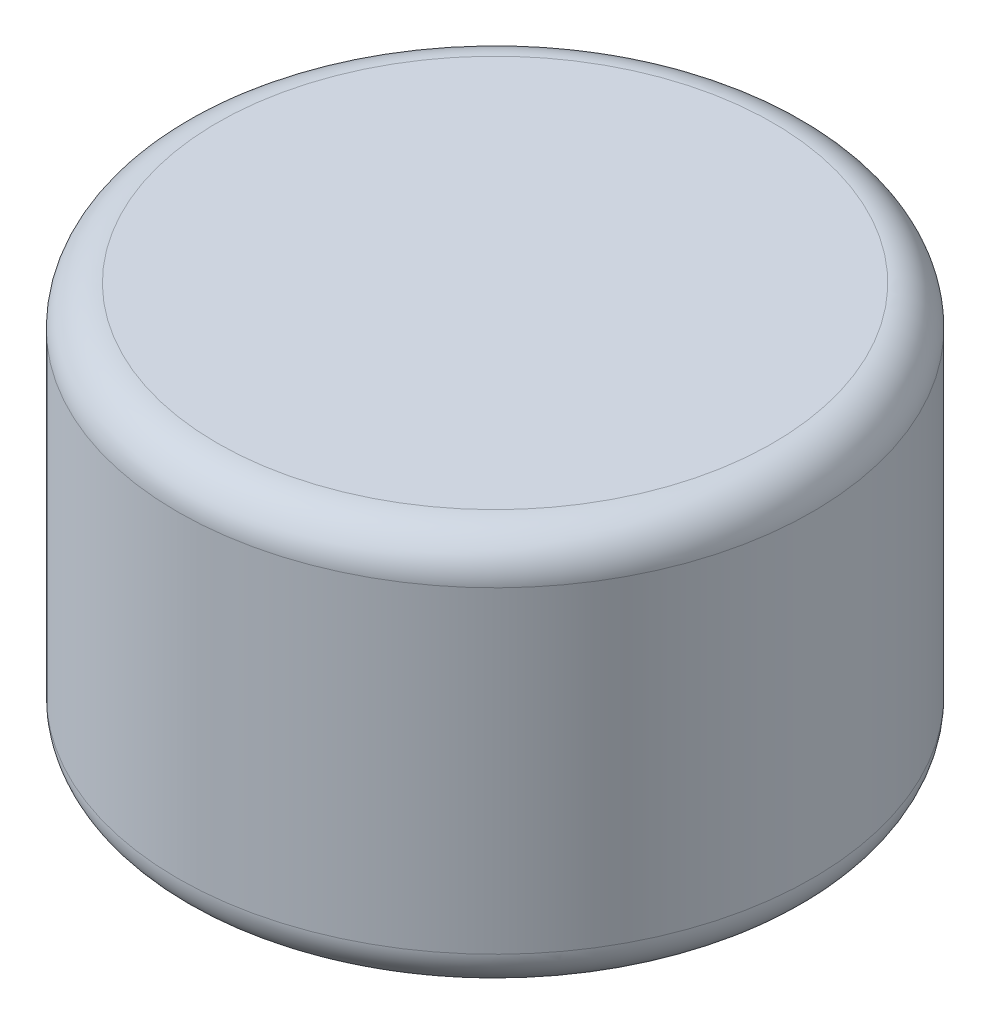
ISO-10303-21;
HEADER;
FILE_DESCRIPTION(('STEP AP214'),'2;1');
FILE_NAME('part.step','',(''),(''),'','','');
FILE_SCHEMA(('AUTOMOTIVE_DESIGN { 1 0 10303 214 1 1 1 1 }'));
ENDSEC;
DATA;
#1=APPLICATION_CONTEXT('core data for automotive mechanical design processes');
#2=APPLICATION_PROTOCOL_DEFINITION('international standard','automotive_design',2000,#1);
#3=PRODUCT_CONTEXT('',#1,'mechanical');
#4=PRODUCT('Part','Part','',(#3));
#5=PRODUCT_RELATED_PRODUCT_CATEGORY('part','',(#4));
#6=PRODUCT_DEFINITION_FORMATION('','',#4);
#7=PRODUCT_DEFINITION_CONTEXT('part definition',#1,'design');
#8=PRODUCT_DEFINITION('design','',#6,#7);
#9=PRODUCT_DEFINITION_SHAPE('','',#8);
#10=(LENGTH_UNIT() NAMED_UNIT(*) SI_UNIT(.MILLI.,.METRE.));
#11=(NAMED_UNIT(*) PLANE_ANGLE_UNIT() SI_UNIT($,.RADIAN.));
#12=(NAMED_UNIT(*) SI_UNIT($,.STERADIAN.) SOLID_ANGLE_UNIT());
#13=UNCERTAINTY_MEASURE_WITH_UNIT(LENGTH_MEASURE(1.E-05),#10,'distance_accuracy_value','');
#14=(GEOMETRIC_REPRESENTATION_CONTEXT(3) GLOBAL_UNCERTAINTY_ASSIGNED_CONTEXT((#13)) GLOBAL_UNIT_ASSIGNED_CONTEXT((#10,
#11,#12)) REPRESENTATION_CONTEXT('',''));
#15=CARTESIAN_POINT('',(0.,0.,0.));
#16=DIRECTION('',(0.,0.,1.));
#17=DIRECTION('',(1.,0.,0.));
#18=AXIS2_PLACEMENT_3D('',#15,#16,#17);
#19=CARTESIAN_POINT('',(0.,5.,0.));
#20=DIRECTION('',(0.,-1.,0.));
#21=DIRECTION('',(0.,0.,-1.));
#22=AXIS2_PLACEMENT_3D('',#19,#20,#21);
#23=CYLINDRICAL_SURFACE('',#22,4.);
#24=CARTESIAN_POINT('',(0.,0.5,0.));
#25=DIRECTION('',(0.,1.,0.));
#26=DIRECTION('',(0.,0.,1.));
#27=AXIS2_PLACEMENT_3D('',#24,#25,#26);
#28=CIRCLE('',#27,4.);
#29=CARTESIAN_POINT('',(0.,0.5,4.));
#30=VERTEX_POINT('',#29);
#31=EDGE_CURVE('E25',#30,#30,#28,.T.);
#32=ORIENTED_EDGE('',*,*,#31,.T.);
#33=EDGE_LOOP('',(#32));
#34=FACE_BOUND('',#33,.T.);
#35=CARTESIAN_POINT('',(0.,4.5,0.));
#36=DIRECTION('',(0.,1.,0.));
#37=DIRECTION('',(0.,0.,1.));
#38=AXIS2_PLACEMENT_3D('',#35,#36,#37);
#39=CIRCLE('',#38,4.);
#40=CARTESIAN_POINT('',(0.,4.5,4.));
#41=VERTEX_POINT('',#40);
#42=EDGE_CURVE('E29',#41,#41,#39,.F.);
#43=ORIENTED_EDGE('',*,*,#42,.T.);
#44=EDGE_LOOP('',(#43));
#45=FACE_BOUND('',#44,.T.);
#46=ADVANCED_FACE('F15',(#34,#45),#23,.T.);
#47=CARTESIAN_POINT('',(0.,5.,0.));
#48=DIRECTION('',(0.,1.,0.));
#49=DIRECTION('',(0.,0.,1.));
#50=AXIS2_PLACEMENT_3D('',#47,#48,#49);
#51=PLANE('',#50);
#52=CARTESIAN_POINT('',(0.,5.,0.));
#53=DIRECTION('',(0.,1.,0.));
#54=DIRECTION('',(0.,0.,1.));
#55=AXIS2_PLACEMENT_3D('',#52,#53,#54);
#56=CIRCLE('',#55,3.5);
#57=CARTESIAN_POINT('',(0.,5.,3.5));
#58=VERTEX_POINT('',#57);
#59=EDGE_CURVE('E10',#58,#58,#56,.T.);
#60=ORIENTED_EDGE('',*,*,#59,.T.);
#61=EDGE_LOOP('',(#60));
#62=FACE_BOUND('',#61,.T.);
#63=ADVANCED_FACE('F50',(#62),#51,.T.);
#64=CARTESIAN_POINT('',(0.,0.,0.));
#65=DIRECTION('',(0.,1.,0.));
#66=DIRECTION('',(0.,0.,1.));
#67=AXIS2_PLACEMENT_3D('',#64,#65,#66);
#68=PLANE('',#67);
#69=CARTESIAN_POINT('',(0.,0.,0.));
#70=DIRECTION('',(0.,1.,0.));
#71=DIRECTION('',(0.,0.,1.));
#72=AXIS2_PLACEMENT_3D('',#69,#70,#71);
#73=CIRCLE('',#72,3.5);
#74=CARTESIAN_POINT('',(0.,0.,3.5));
#75=VERTEX_POINT('',#74);
#76=EDGE_CURVE('E21',#75,#75,#73,.F.);
#77=ORIENTED_EDGE('',*,*,#76,.T.);
#78=EDGE_LOOP('',(#77));
#79=FACE_BOUND('',#78,.T.);
#80=ADVANCED_FACE('F46',(#79),#68,.F.);
#81=CARTESIAN_POINT('',(0.,0.5,0.));
#82=DIRECTION('',(0.,1.,0.));
#83=DIRECTION('',(0.,0.,1.));
#84=AXIS2_PLACEMENT_3D('',#81,#82,#83);
#85=TOROIDAL_SURFACE('',#84,3.5,0.5);
#86=ORIENTED_EDGE('',*,*,#76,.F.);
#87=EDGE_LOOP('',(#86));
#88=FACE_BOUND('',#87,.T.);
#89=ORIENTED_EDGE('',*,*,#31,.F.);
#90=EDGE_LOOP('',(#89));
#91=FACE_BOUND('',#90,.T.);
#92=ADVANCED_FACE('F39',(#88,#91),#85,.T.);
#93=CARTESIAN_POINT('',(0.,4.5,0.));
#94=DIRECTION('',(0.,1.,0.));
#95=DIRECTION('',(0.,0.,1.));
#96=AXIS2_PLACEMENT_3D('',#93,#94,#95);
#97=TOROIDAL_SURFACE('',#96,3.5,0.5);
#98=ORIENTED_EDGE('',*,*,#42,.F.);
#99=EDGE_LOOP('',(#98));
#100=FACE_BOUND('',#99,.T.);
#101=ORIENTED_EDGE('',*,*,#59,.F.);
#102=EDGE_LOOP('',(#101));
#103=FACE_BOUND('',#102,.T.);
#104=ADVANCED_FACE('F36',(#100,#103),#97,.T.);
#105=CLOSED_SHELL('',(#46,#63,#80,#92,#104));
#106=MANIFOLD_SOLID_BREP('B1',#105);
#107=ADVANCED_BREP_SHAPE_REPRESENTATION('',(#18,#106),#14);
#108=SHAPE_DEFINITION_REPRESENTATION(#9,#107);
ENDSEC;
END-ISO-10303-21;
